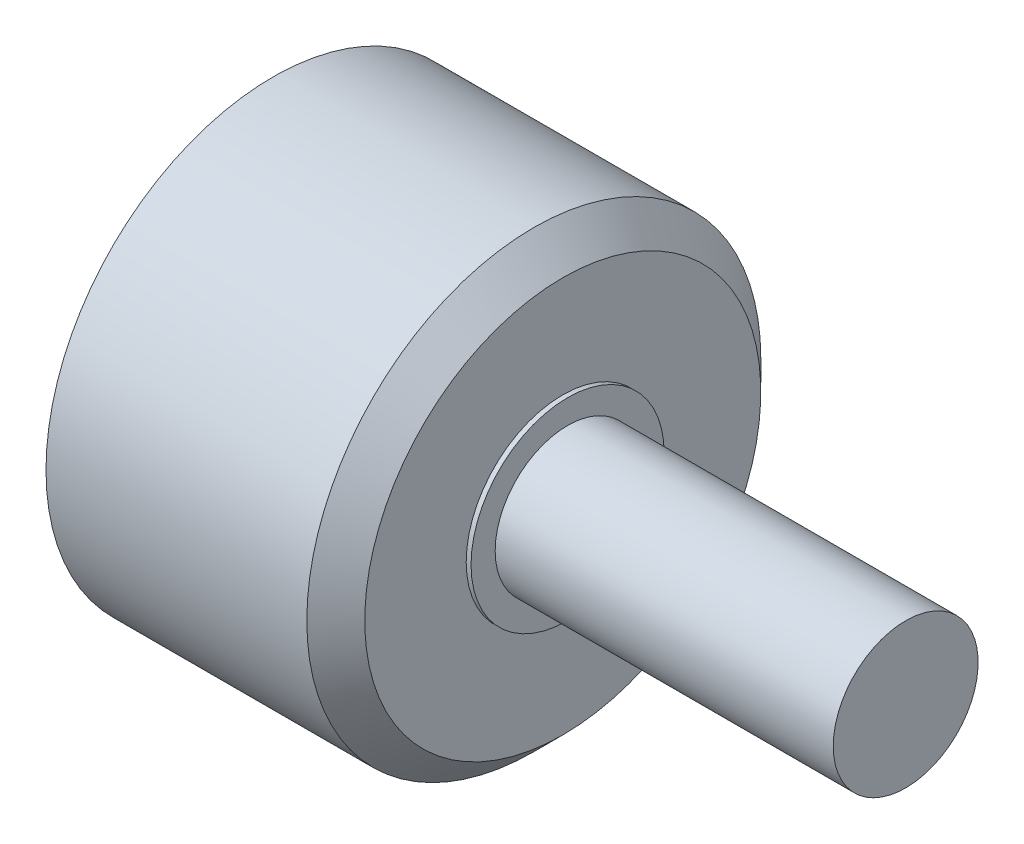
ISO-10303-21;
HEADER;
FILE_DESCRIPTION(('STEP AP214'),'2;1');
FILE_NAME('part.step','',(''),(''),'','','');
FILE_SCHEMA(('AUTOMOTIVE_DESIGN { 1 0 10303 214 1 1 1 1 }'));
ENDSEC;
DATA;
#1=APPLICATION_CONTEXT('core data for automotive mechanical design processes');
#2=APPLICATION_PROTOCOL_DEFINITION('international standard','automotive_design',2000,#1);
#3=PRODUCT_CONTEXT('',#1,'mechanical');
#4=PRODUCT('Part','Part','',(#3));
#5=PRODUCT_RELATED_PRODUCT_CATEGORY('part','',(#4));
#6=PRODUCT_DEFINITION_FORMATION('','',#4);
#7=PRODUCT_DEFINITION_CONTEXT('part definition',#1,'design');
#8=PRODUCT_DEFINITION('design','',#6,#7);
#9=PRODUCT_DEFINITION_SHAPE('','',#8);
#10=(LENGTH_UNIT() NAMED_UNIT(*) SI_UNIT(.MILLI.,.METRE.));
#11=(NAMED_UNIT(*) PLANE_ANGLE_UNIT() SI_UNIT($,.RADIAN.));
#12=(NAMED_UNIT(*) SI_UNIT($,.STERADIAN.) SOLID_ANGLE_UNIT());
#13=UNCERTAINTY_MEASURE_WITH_UNIT(LENGTH_MEASURE(1.E-05),#10,'distance_accuracy_value','');
#14=(GEOMETRIC_REPRESENTATION_CONTEXT(3) GLOBAL_UNCERTAINTY_ASSIGNED_CONTEXT((#13)) GLOBAL_UNIT_ASSIGNED_CONTEXT((#10,
#11,#12)) REPRESENTATION_CONTEXT('',''));
#15=CARTESIAN_POINT('',(0.,0.,0.));
#16=DIRECTION('',(0.,0.,1.));
#17=DIRECTION('',(1.,0.,0.));
#18=AXIS2_PLACEMENT_3D('',#15,#16,#17);
#19=CARTESIAN_POINT('',(65.5,0.,0.));
#20=DIRECTION('',(1.,0.,0.));
#21=DIRECTION('',(0.,0.,-1.));
#22=AXIS2_PLACEMENT_3D('',#19,#20,#21);
#23=PLANE('',#22);
#24=CARTESIAN_POINT('',(65.5,0.,0.));
#25=DIRECTION('',(-1.,0.,0.));
#26=DIRECTION('',(0.,0.,1.));
#27=AXIS2_PLACEMENT_3D('',#24,#25,#26);
#28=CIRCLE('',#27,7.5);
#29=CARTESIAN_POINT('',(65.5,0.,7.5));
#30=VERTEX_POINT('',#29);
#31=EDGE_CURVE('E18',#30,#30,#28,.T.);
#32=ORIENTED_EDGE('',*,*,#31,.F.);
#33=EDGE_LOOP('',(#32));
#34=FACE_BOUND('',#33,.T.);
#35=ADVANCED_FACE('F15',(#34),#23,.T.);
#36=CARTESIAN_POINT('',(65.5,0.,0.));
#37=DIRECTION('',(-1.,0.,0.));
#38=DIRECTION('',(0.,0.,1.));
#39=AXIS2_PLACEMENT_3D('',#36,#37,#38);
#40=CYLINDRICAL_SURFACE('',#39,7.5);
#41=CARTESIAN_POINT('',(30.5,0.,0.));
#42=DIRECTION('',(-1.,0.,0.));
#43=DIRECTION('',(0.,0.,1.));
#44=AXIS2_PLACEMENT_3D('',#41,#42,#43);
#45=CIRCLE('',#44,7.5);
#46=CARTESIAN_POINT('',(30.5,0.,7.5));
#47=VERTEX_POINT('',#46);
#48=EDGE_CURVE('E37',#47,#47,#45,.T.);
#49=ORIENTED_EDGE('',*,*,#48,.F.);
#50=EDGE_LOOP('',(#49));
#51=FACE_BOUND('',#50,.T.);
#52=ORIENTED_EDGE('',*,*,#31,.T.);
#53=EDGE_LOOP('',(#52));
#54=FACE_BOUND('',#53,.T.);
#55=ADVANCED_FACE('F44',(#51,#54),#40,.T.);
#56=CARTESIAN_POINT('',(30.5,0.,0.));
#57=DIRECTION('',(1.,0.,0.));
#58=DIRECTION('',(0.,0.,-1.));
#59=AXIS2_PLACEMENT_3D('',#56,#57,#58);
#60=PLANE('',#59);
#61=ORIENTED_EDGE('',*,*,#48,.T.);
#62=EDGE_LOOP('',(#61));
#63=FACE_BOUND('',#62,.T.);
#64=CARTESIAN_POINT('',(30.5,0.,0.));
#65=DIRECTION('',(-1.,0.,0.));
#66=DIRECTION('',(0.,0.,1.));
#67=AXIS2_PLACEMENT_3D('',#64,#65,#66);
#68=CIRCLE('',#67,10.);
#69=CARTESIAN_POINT('',(30.5,0.,10.));
#70=VERTEX_POINT('',#69);
#71=EDGE_CURVE('E35',#70,#70,#68,.T.);
#72=ORIENTED_EDGE('',*,*,#71,.F.);
#73=EDGE_LOOP('',(#72));
#74=FACE_BOUND('',#73,.T.);
#75=ADVANCED_FACE('F51',(#63,#74),#60,.T.);
#76=CARTESIAN_POINT('',(30.5,0.,0.));
#77=DIRECTION('',(-1.,0.,0.));
#78=DIRECTION('',(0.,0.,1.));
#79=AXIS2_PLACEMENT_3D('',#76,#77,#78);
#80=CYLINDRICAL_SURFACE('',#79,10.);
#81=CARTESIAN_POINT('',(30.,0.,0.));
#82=DIRECTION('',(-1.,0.,0.));
#83=DIRECTION('',(0.,0.,1.));
#84=AXIS2_PLACEMENT_3D('',#81,#82,#83);
#85=CIRCLE('',#84,10.);
#86=CARTESIAN_POINT('',(30.,0.,10.));
#87=VERTEX_POINT('',#86);
#88=EDGE_CURVE('E32',#87,#87,#85,.T.);
#89=ORIENTED_EDGE('',*,*,#88,.F.);
#90=EDGE_LOOP('',(#89));
#91=FACE_BOUND('',#90,.T.);
#92=ORIENTED_EDGE('',*,*,#71,.T.);
#93=EDGE_LOOP('',(#92));
#94=FACE_BOUND('',#93,.T.);
#95=ADVANCED_FACE('F71',(#91,#94),#80,.T.);
#96=CARTESIAN_POINT('',(30.,0.,0.));
#97=DIRECTION('',(1.,0.,0.));
#98=DIRECTION('',(0.,0.,-1.));
#99=AXIS2_PLACEMENT_3D('',#96,#97,#98);
#100=PLANE('',#99);
#101=ORIENTED_EDGE('',*,*,#88,.T.);
#102=EDGE_LOOP('',(#101));
#103=FACE_BOUND('',#102,.T.);
#104=CARTESIAN_POINT('',(30.,0.,0.));
#105=DIRECTION('',(-1.,0.,0.));
#106=DIRECTION('',(0.,-1.,0.));
#107=AXIS2_PLACEMENT_3D('',#104,#105,#106);
#108=CIRCLE('',#107,20.5);
#109=CARTESIAN_POINT('',(30.,-20.5,0.));
#110=VERTEX_POINT('',#109);
#111=EDGE_CURVE('E27',#110,#110,#108,.T.);
#112=ORIENTED_EDGE('',*,*,#111,.F.);
#113=EDGE_LOOP('',(#112));
#114=FACE_BOUND('',#113,.T.);
#115=ADVANCED_FACE('F67',(#103,#114),#100,.T.);
#116=CARTESIAN_POINT('',(27.,0.,0.));
#117=DIRECTION('',(-1.,0.,0.));
#118=DIRECTION('',(0.,-1.,0.));
#119=AXIS2_PLACEMENT_3D('',#116,#117,#118);
#120=CONICAL_SURFACE('',#119,23.5,0.785398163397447);
#121=CARTESIAN_POINT('',(27.,0.,0.));
#122=DIRECTION('',(-1.,0.,0.));
#123=DIRECTION('',(0.,0.,1.));
#124=AXIS2_PLACEMENT_3D('',#121,#122,#123);
#125=CIRCLE('',#124,23.5);
#126=CARTESIAN_POINT('',(27.,0.,23.5));
#127=VERTEX_POINT('',#126);
#128=EDGE_CURVE('E22',#127,#127,#125,.T.);
#129=ORIENTED_EDGE('',*,*,#128,.F.);
#130=EDGE_LOOP('',(#129));
#131=FACE_BOUND('',#130,.T.);
#132=ORIENTED_EDGE('',*,*,#111,.T.);
#133=EDGE_LOOP('',(#132));
#134=FACE_BOUND('',#133,.T.);
#135=ADVANCED_FACE('F60',(#131,#134),#120,.T.);
#136=CARTESIAN_POINT('',(0.,0.,0.));
#137=DIRECTION('',(1.,0.,0.));
#138=DIRECTION('',(0.,0.,-1.));
#139=AXIS2_PLACEMENT_3D('',#136,#137,#138);
#140=PLANE('',#139);
#141=CARTESIAN_POINT('',(0.,0.,0.));
#142=DIRECTION('',(-1.,0.,0.));
#143=DIRECTION('',(0.,0.,1.));
#144=AXIS2_PLACEMENT_3D('',#141,#142,#143);
#145=CIRCLE('',#144,23.5);
#146=CARTESIAN_POINT('',(0.,0.,23.5));
#147=VERTEX_POINT('',#146);
#148=EDGE_CURVE('E10',#147,#147,#145,.F.);
#149=ORIENTED_EDGE('',*,*,#148,.F.);
#150=EDGE_LOOP('',(#149));
#151=FACE_BOUND('',#150,.T.);
#152=ADVANCED_FACE('F55',(#151),#140,.F.);
#153=CARTESIAN_POINT('',(30.,0.,0.));
#154=DIRECTION('',(-1.,0.,0.));
#155=DIRECTION('',(0.,0.,1.));
#156=AXIS2_PLACEMENT_3D('',#153,#154,#155);
#157=CYLINDRICAL_SURFACE('',#156,23.5);
#158=ORIENTED_EDGE('',*,*,#148,.T.);
#159=EDGE_LOOP('',(#158));
#160=FACE_BOUND('',#159,.T.);
#161=ORIENTED_EDGE('',*,*,#128,.T.);
#162=EDGE_LOOP('',(#161));
#163=FACE_BOUND('',#162,.T.);
#164=ADVANCED_FACE('F53',(#160,#163),#157,.T.);
#165=CLOSED_SHELL('',(#35,#55,#75,#95,#115,#135,#152,#164));
#166=MANIFOLD_SOLID_BREP('B1',#165);
#167=ADVANCED_BREP_SHAPE_REPRESENTATION('',(#18,#166),#14);
#168=SHAPE_DEFINITION_REPRESENTATION(#9,#167);
ENDSEC;
END-ISO-10303-21;
